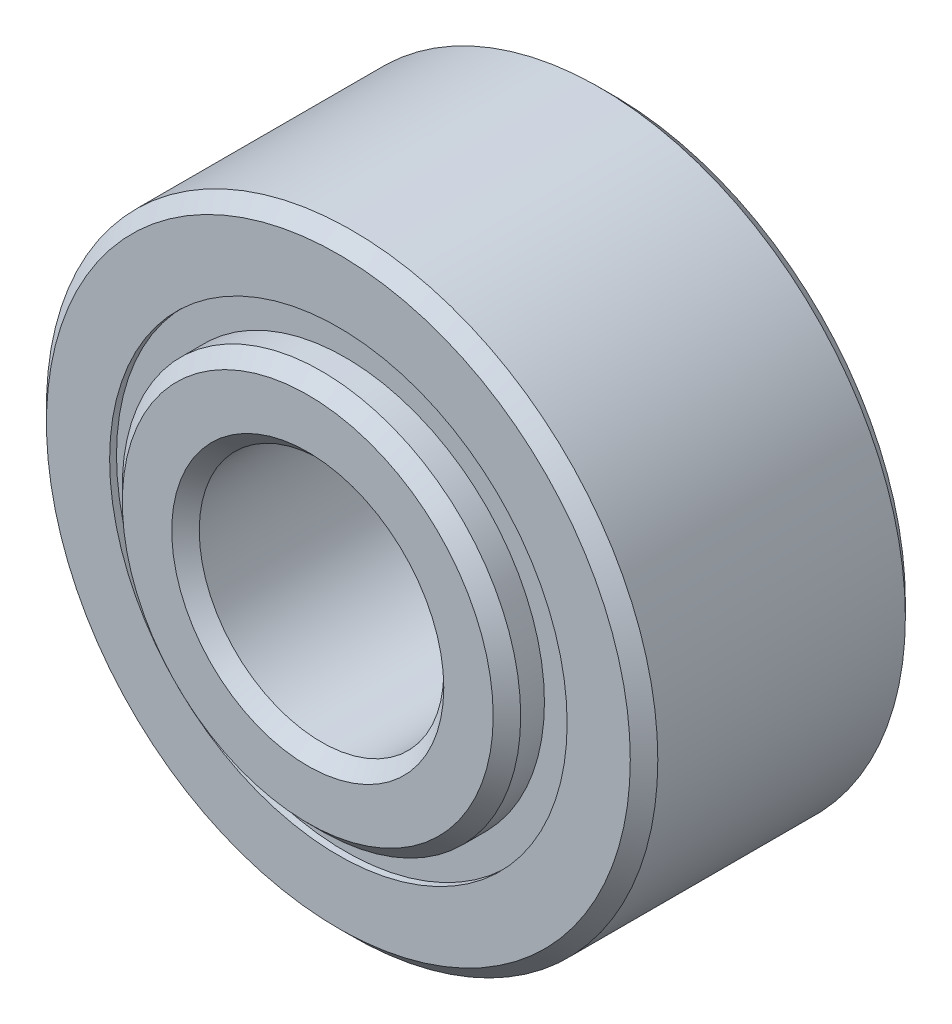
ISO-10303-21;
HEADER;
FILE_DESCRIPTION(('STEP AP214'),'2;1');
FILE_NAME('part.step','',(''),(''),'','','');
FILE_SCHEMA(('AUTOMOTIVE_DESIGN { 1 0 10303 214 1 1 1 1 }'));
ENDSEC;
DATA;
#1=APPLICATION_CONTEXT('core data for automotive mechanical design processes');
#2=APPLICATION_PROTOCOL_DEFINITION('international standard','automotive_design',2000,#1);
#3=PRODUCT_CONTEXT('',#1,'mechanical');
#4=PRODUCT('Part','Part','',(#3));
#5=PRODUCT_RELATED_PRODUCT_CATEGORY('part','',(#4));
#6=PRODUCT_DEFINITION_FORMATION('','',#4);
#7=PRODUCT_DEFINITION_CONTEXT('part definition',#1,'design');
#8=PRODUCT_DEFINITION('design','',#6,#7);
#9=PRODUCT_DEFINITION_SHAPE('','',#8);
#10=(LENGTH_UNIT() NAMED_UNIT(*) SI_UNIT(.MILLI.,.METRE.));
#11=(NAMED_UNIT(*) PLANE_ANGLE_UNIT() SI_UNIT($,.RADIAN.));
#12=(NAMED_UNIT(*) SI_UNIT($,.STERADIAN.) SOLID_ANGLE_UNIT());
#13=UNCERTAINTY_MEASURE_WITH_UNIT(LENGTH_MEASURE(1.E-05),#10,'distance_accuracy_value','');
#14=(GEOMETRIC_REPRESENTATION_CONTEXT(3) GLOBAL_UNCERTAINTY_ASSIGNED_CONTEXT((#13)) GLOBAL_UNIT_ASSIGNED_CONTEXT((#10,
#11,#12)) REPRESENTATION_CONTEXT('',''));
#15=CARTESIAN_POINT('',(0.,0.,0.));
#16=DIRECTION('',(0.,0.,1.));
#17=DIRECTION('',(1.,0.,0.));
#18=AXIS2_PLACEMENT_3D('',#15,#16,#17);
#19=CARTESIAN_POINT('',(0.,2.97004851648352,-1.696339));
#20=DIRECTION('',(0.,0.,1.));
#21=DIRECTION('',(1.,0.,0.));
#22=AXIS2_PLACEMENT_3D('',#19,#20,#21);
#23=PLANE('',#22);
#24=CARTESIAN_POINT('',(0.,0.,-1.696339));
#25=DIRECTION('',(0.,0.,1.));
#26=DIRECTION('',(1.,0.,0.));
#27=AXIS2_PLACEMENT_3D('',#24,#25,#26);
#28=CIRCLE('',#27,2.97004851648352);
#29=CARTESIAN_POINT('',(2.97004851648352,0.,-1.696339));
#30=VERTEX_POINT('',#29);
#31=EDGE_CURVE('E66',#30,#30,#28,.T.);
#32=ORIENTED_EDGE('',*,*,#31,.F.);
#33=EDGE_LOOP('',(#32));
#34=FACE_BOUND('',#33,.T.);
#35=CARTESIAN_POINT('',(0.,0.,-1.696339));
#36=DIRECTION('',(0.,0.,1.));
#37=DIRECTION('',(1.,0.,0.));
#38=AXIS2_PLACEMENT_3D('',#35,#36,#37);
#39=CIRCLE('',#38,2.58620148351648);
#40=CARTESIAN_POINT('',(2.58620148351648,0.,-1.696339));
#41=VERTEX_POINT('',#40);
#42=EDGE_CURVE('E11',#41,#41,#39,.T.);
#43=ORIENTED_EDGE('',*,*,#42,.T.);
#44=EDGE_LOOP('',(#43));
#45=FACE_BOUND('',#44,.T.);
#46=ADVANCED_FACE('F52',(#34,#45),#23,.F.);
#47=CARTESIAN_POINT('',(0.,0.,1.78562));
#48=DIRECTION('',(0.,0.,1.));
#49=DIRECTION('',(1.,0.,0.));
#50=AXIS2_PLACEMENT_3D('',#47,#48,#49);
#51=CYLINDRICAL_SURFACE('',#50,2.58620148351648);
#52=ORIENTED_EDGE('',*,*,#42,.F.);
#53=EDGE_LOOP('',(#52));
#54=FACE_BOUND('',#53,.T.);
#55=CARTESIAN_POINT('',(0.,0.,-0.816486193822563));
#56=DIRECTION('',(0.,0.,1.));
#57=DIRECTION('',(1.,0.,0.));
#58=AXIS2_PLACEMENT_3D('',#55,#56,#57);
#59=CIRCLE('',#58,2.58620148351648);
#60=CARTESIAN_POINT('',(2.58620148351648,0.,-0.816486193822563));
#61=VERTEX_POINT('',#60);
#62=EDGE_CURVE('E58',#61,#61,#59,.T.);
#63=ORIENTED_EDGE('',*,*,#62,.T.);
#64=EDGE_LOOP('',(#63));
#65=FACE_BOUND('',#64,.T.);
#66=ADVANCED_FACE('F75',(#54,#65),#51,.F.);
#67=CARTESIAN_POINT('',(0.,2.97004851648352,-0.816486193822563));
#68=DIRECTION('',(0.,0.,-1.));
#69=DIRECTION('',(-1.,0.,0.));
#70=AXIS2_PLACEMENT_3D('',#67,#68,#69);
#71=PLANE('',#70);
#72=ORIENTED_EDGE('',*,*,#62,.F.);
#73=EDGE_LOOP('',(#72));
#74=FACE_BOUND('',#73,.T.);
#75=CARTESIAN_POINT('',(0.,0.,-0.816486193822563));
#76=DIRECTION('',(0.,0.,1.));
#77=DIRECTION('',(1.,0.,0.));
#78=AXIS2_PLACEMENT_3D('',#75,#76,#77);
#79=CIRCLE('',#78,2.97004851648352);
#80=CARTESIAN_POINT('',(2.97004851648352,0.,-0.816486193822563));
#81=VERTEX_POINT('',#80);
#82=EDGE_CURVE('E62',#81,#81,#79,.T.);
#83=ORIENTED_EDGE('',*,*,#82,.T.);
#84=EDGE_LOOP('',(#83));
#85=FACE_BOUND('',#84,.T.);
#86=ADVANCED_FACE('F79',(#74,#85),#71,.F.);
#87=CARTESIAN_POINT('',(0.,0.,1.78562));
#88=DIRECTION('',(0.,0.,1.));
#89=DIRECTION('',(1.,0.,0.));
#90=AXIS2_PLACEMENT_3D('',#87,#88,#89);
#91=CYLINDRICAL_SURFACE('',#90,2.97004851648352);
#92=ORIENTED_EDGE('',*,*,#82,.F.);
#93=EDGE_LOOP('',(#92));
#94=FACE_BOUND('',#93,.T.);
#95=ORIENTED_EDGE('',*,*,#31,.T.);
#96=EDGE_LOOP('',(#95));
#97=FACE_BOUND('',#96,.T.);
#98=ADVANCED_FACE('F72',(#94,#97),#91,.T.);
#99=CLOSED_SHELL('',(#46,#66,#86,#98));
#100=MANIFOLD_SOLID_BREP('B2',#99);
#101=CARTESIAN_POINT('',(0.,2.97004851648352,1.696339));
#102=DIRECTION('',(0.,0.,-1.));
#103=DIRECTION('',(-1.,0.,0.));
#104=AXIS2_PLACEMENT_3D('',#101,#102,#103);
#105=PLANE('',#104);
#106=CARTESIAN_POINT('',(0.,0.,1.696339));
#107=DIRECTION('',(0.,0.,1.));
#108=DIRECTION('',(1.,0.,0.));
#109=AXIS2_PLACEMENT_3D('',#106,#107,#108);
#110=CIRCLE('',#109,2.58620148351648);
#111=CARTESIAN_POINT('',(2.58620148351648,0.,1.696339));
#112=VERTEX_POINT('',#111);
#113=EDGE_CURVE('E51',#112,#112,#110,.T.);
#114=ORIENTED_EDGE('',*,*,#113,.F.);
#115=EDGE_LOOP('',(#114));
#116=FACE_BOUND('',#115,.T.);
#117=CARTESIAN_POINT('',(0.,0.,1.696339));
#118=DIRECTION('',(0.,0.,1.));
#119=DIRECTION('',(1.,0.,0.));
#120=AXIS2_PLACEMENT_3D('',#117,#118,#119);
#121=CIRCLE('',#120,2.97004851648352);
#122=CARTESIAN_POINT('',(2.97004851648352,0.,1.696339));
#123=VERTEX_POINT('',#122);
#124=EDGE_CURVE('E138',#123,#123,#121,.T.);
#125=ORIENTED_EDGE('',*,*,#124,.T.);
#126=EDGE_LOOP('',(#125));
#127=FACE_BOUND('',#126,.T.);
#128=ADVANCED_FACE('F120',(#116,#127),#105,.F.);
#129=CARTESIAN_POINT('',(0.,0.,1.78562));
#130=DIRECTION('',(0.,0.,1.));
#131=DIRECTION('',(1.,0.,0.));
#132=AXIS2_PLACEMENT_3D('',#129,#130,#131);
#133=CYLINDRICAL_SURFACE('',#132,2.58620148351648);
#134=CARTESIAN_POINT('',(0.,0.,0.816486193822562));
#135=DIRECTION('',(0.,0.,1.));
#136=DIRECTION('',(1.,0.,0.));
#137=AXIS2_PLACEMENT_3D('',#134,#135,#136);
#138=CIRCLE('',#137,2.58620148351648);
#139=CARTESIAN_POINT('',(2.58620148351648,0.,0.816486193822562));
#140=VERTEX_POINT('',#139);
#141=EDGE_CURVE('E127',#140,#140,#138,.T.);
#142=ORIENTED_EDGE('',*,*,#141,.F.);
#143=EDGE_LOOP('',(#142));
#144=FACE_BOUND('',#143,.T.);
#145=ORIENTED_EDGE('',*,*,#113,.T.);
#146=EDGE_LOOP('',(#145));
#147=FACE_BOUND('',#146,.T.);
#148=ADVANCED_FACE('F153',(#144,#147),#133,.F.);
#149=CARTESIAN_POINT('',(0.,2.97004851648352,0.816486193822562));
#150=DIRECTION('',(0.,0.,1.));
#151=DIRECTION('',(1.,0.,0.));
#152=AXIS2_PLACEMENT_3D('',#149,#150,#151);
#153=PLANE('',#152);
#154=CARTESIAN_POINT('',(0.,0.,0.816486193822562));
#155=DIRECTION('',(0.,0.,1.));
#156=DIRECTION('',(1.,0.,0.));
#157=AXIS2_PLACEMENT_3D('',#154,#155,#156);
#158=CIRCLE('',#157,2.97004851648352);
#159=CARTESIAN_POINT('',(2.97004851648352,0.,0.816486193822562));
#160=VERTEX_POINT('',#159);
#161=EDGE_CURVE('E132',#160,#160,#158,.T.);
#162=ORIENTED_EDGE('',*,*,#161,.F.);
#163=EDGE_LOOP('',(#162));
#164=FACE_BOUND('',#163,.T.);
#165=ORIENTED_EDGE('',*,*,#141,.T.);
#166=EDGE_LOOP('',(#165));
#167=FACE_BOUND('',#166,.T.);
#168=ADVANCED_FACE('F148',(#164,#167),#153,.F.);
#169=CARTESIAN_POINT('',(0.,0.,1.78562));
#170=DIRECTION('',(0.,0.,1.));
#171=DIRECTION('',(1.,0.,0.));
#172=AXIS2_PLACEMENT_3D('',#169,#170,#171);
#173=CYLINDRICAL_SURFACE('',#172,2.97004851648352);
#174=ORIENTED_EDGE('',*,*,#124,.F.);
#175=EDGE_LOOP('',(#174));
#176=FACE_BOUND('',#175,.T.);
#177=ORIENTED_EDGE('',*,*,#161,.T.);
#178=EDGE_LOOP('',(#177));
#179=FACE_BOUND('',#178,.T.);
#180=ADVANCED_FACE('F145',(#176,#179),#173,.T.);
#181=CLOSED_SHELL('',(#128,#148,#168,#180));
#182=MANIFOLD_SOLID_BREP('B6',#181);
#183=CARTESIAN_POINT('',(-1.632940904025,2.24755033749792,0.));
#184=DIRECTION('',(0.,0.,1.));
#185=DIRECTION('',(-0.587785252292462,0.809016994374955,0.));
#186=AXIS2_PLACEMENT_3D('',#183,#184,#185);
#187=SPHERICAL_SURFACE('',#186,0.816486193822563);
#188=CARTESIAN_POINT('',(-1.632940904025,2.24755033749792,0.816486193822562));
#189=VERTEX_POINT('',#188);
#190=VERTEX_LOOP('',#189);
#191=FACE_BOUND('',#190,.T.);
#192=ADVANCED_FACE('F191',(#191),#187,.T.);
#193=CLOSED_SHELL('',(#192));
#194=MANIFOLD_SOLID_BREP('B46',#193);
#195=CARTESIAN_POINT('',(-2.64215388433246,0.858487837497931,0.));
#196=DIRECTION('',(0.,0.,1.));
#197=DIRECTION('',(-0.95105651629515,0.309016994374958,0.));
#198=AXIS2_PLACEMENT_3D('',#195,#196,#197);
#199=SPHERICAL_SURFACE('',#198,0.816486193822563);
#200=CARTESIAN_POINT('',(-2.64215388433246,0.858487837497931,0.816486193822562));
#201=VERTEX_POINT('',#200);
#202=VERTEX_LOOP('',#201);
#203=FACE_BOUND('',#202,.T.);
#204=ADVANCED_FACE('F211',(#203),#199,.T.);
#205=CLOSED_SHELL('',(#204));
#206=MANIFOLD_SOLID_BREP('B116',#205);
#207=CARTESIAN_POINT('',(-2.64215388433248,-0.858487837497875,0.));
#208=DIRECTION('',(0.,0.,1.));
#209=DIRECTION('',(-0.951056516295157,-0.309016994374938,0.));
#210=AXIS2_PLACEMENT_3D('',#207,#208,#209);
#211=SPHERICAL_SURFACE('',#210,0.816486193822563);
#212=CARTESIAN_POINT('',(-2.64215388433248,-0.858487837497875,0.816486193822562));
#213=VERTEX_POINT('',#212);
#214=VERTEX_LOOP('',#213);
#215=FACE_BOUND('',#214,.T.);
#216=ADVANCED_FACE('F231',(#215),#211,.T.);
#217=CLOSED_SHELL('',(#216));
#218=MANIFOLD_SOLID_BREP('B187',#217);
#219=CARTESIAN_POINT('',(-1.63294090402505,-2.24755033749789,0.));
#220=DIRECTION('',(0.,0.,1.));
#221=DIRECTION('',(-0.58778525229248,-0.809016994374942,0.));
#222=AXIS2_PLACEMENT_3D('',#219,#220,#221);
#223=SPHERICAL_SURFACE('',#222,0.816486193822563);
#224=CARTESIAN_POINT('',(-1.63294090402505,-2.24755033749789,0.816486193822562));
#225=VERTEX_POINT('',#224);
#226=VERTEX_LOOP('',#225);
#227=FACE_BOUND('',#226,.T.);
#228=ADVANCED_FACE('F251',(#227),#223,.T.);
#229=CLOSED_SHELL('',(#228));
#230=MANIFOLD_SOLID_BREP('B207',#229);
#231=CARTESIAN_POINT('',(0.,-2.778125,0.));
#232=DIRECTION('',(0.,0.,1.));
#233=DIRECTION('',(0.,-1.,0.));
#234=AXIS2_PLACEMENT_3D('',#231,#232,#233);
#235=SPHERICAL_SURFACE('',#234,0.816486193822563);
#236=CARTESIAN_POINT('',(0.,-2.778125,0.816486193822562));
#237=VERTEX_POINT('',#236);
#238=VERTEX_LOOP('',#237);
#239=FACE_BOUND('',#238,.T.);
#240=ADVANCED_FACE('F271',(#239),#235,.T.);
#241=CLOSED_SHELL('',(#240));
#242=MANIFOLD_SOLID_BREP('B227',#241);
#243=CARTESIAN_POINT('',(1.63294090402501,-2.24755033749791,0.));
#244=DIRECTION('',(0.,0.,1.));
#245=DIRECTION('',(0.587785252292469,-0.809016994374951,0.));
#246=AXIS2_PLACEMENT_3D('',#243,#244,#245);
#247=SPHERICAL_SURFACE('',#246,0.816486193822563);
#248=CARTESIAN_POINT('',(1.63294090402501,-2.24755033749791,0.816486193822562));
#249=VERTEX_POINT('',#248);
#250=VERTEX_LOOP('',#249);
#251=FACE_BOUND('',#250,.T.);
#252=ADVANCED_FACE('F291',(#251),#247,.T.);
#253=CLOSED_SHELL('',(#252));
#254=MANIFOLD_SOLID_BREP('B247',#253);
#255=CARTESIAN_POINT('',(2.64215388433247,-0.858487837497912,0.));
#256=DIRECTION('',(0.,0.,1.));
#257=DIRECTION('',(0.951056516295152,-0.309016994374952,0.));
#258=AXIS2_PLACEMENT_3D('',#255,#256,#257);
#259=SPHERICAL_SURFACE('',#258,0.816486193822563);
#260=CARTESIAN_POINT('',(2.64215388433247,-0.858487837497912,0.816486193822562));
#261=VERTEX_POINT('',#260);
#262=VERTEX_LOOP('',#261);
#263=FACE_BOUND('',#262,.T.);
#264=ADVANCED_FACE('F311',(#263),#259,.T.);
#265=CLOSED_SHELL('',(#264));
#266=MANIFOLD_SOLID_BREP('B267',#265);
#267=CARTESIAN_POINT('',(2.64215388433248,0.858487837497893,0.));
#268=DIRECTION('',(0.,0.,1.));
#269=DIRECTION('',(0.951056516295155,0.309016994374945,0.));
#270=AXIS2_PLACEMENT_3D('',#267,#268,#269);
#271=SPHERICAL_SURFACE('',#270,0.816486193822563);
#272=CARTESIAN_POINT('',(2.64215388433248,0.858487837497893,0.816486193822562));
#273=VERTEX_POINT('',#272);
#274=VERTEX_LOOP('',#273);
#275=FACE_BOUND('',#274,.T.);
#276=ADVANCED_FACE('F331',(#275),#271,.T.);
#277=CLOSED_SHELL('',(#276));
#278=MANIFOLD_SOLID_BREP('B287',#277);
#279=CARTESIAN_POINT('',(1.63294090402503,2.2475503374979,0.));
#280=DIRECTION('',(0.,0.,1.));
#281=DIRECTION('',(0.587785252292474,0.809016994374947,0.));
#282=AXIS2_PLACEMENT_3D('',#279,#280,#281);
#283=SPHERICAL_SURFACE('',#282,0.816486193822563);
#284=CARTESIAN_POINT('',(1.63294090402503,2.2475503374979,0.816486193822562));
#285=VERTEX_POINT('',#284);
#286=VERTEX_LOOP('',#285);
#287=FACE_BOUND('',#286,.T.);
#288=ADVANCED_FACE('F351',(#287),#283,.T.);
#289=CLOSED_SHELL('',(#288));
#290=MANIFOLD_SOLID_BREP('B307',#289);
#291=CARTESIAN_POINT('',(0.,2.778125,0.));
#292=DIRECTION('',(0.,0.,1.));
#293=DIRECTION('',(0.,1.,0.));
#294=AXIS2_PLACEMENT_3D('',#291,#292,#293);
#295=SPHERICAL_SURFACE('',#294,0.816486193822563);
#296=CARTESIAN_POINT('',(0.,2.778125,0.816486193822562));
#297=VERTEX_POINT('',#296);
#298=VERTEX_LOOP('',#297);
#299=FACE_BOUND('',#298,.T.);
#300=ADVANCED_FACE('F374',(#299),#295,.T.);
#301=CLOSED_SHELL('',(#300));
#302=MANIFOLD_SOLID_BREP('B327',#301);
#303=CARTESIAN_POINT('',(0.,0.,2.004568));
#304=DIRECTION('',(0.,0.,-1.));
#305=DIRECTION('',(-1.,0.,0.));
#306=AXIS2_PLACEMENT_3D('',#303,#304,#305);
#307=CONICAL_SURFACE('',#306,2.58620148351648,0.785398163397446);
#308=CARTESIAN_POINT('',(0.,0.,2.18313));
#309=DIRECTION('',(0.,0.,1.));
#310=DIRECTION('',(1.,0.,0.));
#311=AXIS2_PLACEMENT_3D('',#308,#309,#310);
#312=CIRCLE('',#311,2.40763948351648);
#313=CARTESIAN_POINT('',(2.40763948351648,0.,2.18313));
#314=VERTEX_POINT('',#313);
#315=EDGE_CURVE('E433',#314,#314,#312,.T.);
#316=ORIENTED_EDGE('',*,*,#315,.F.);
#317=EDGE_LOOP('',(#316));
#318=FACE_BOUND('',#317,.T.);
#319=CARTESIAN_POINT('',(0.,0.,2.004568));
#320=DIRECTION('',(0.,0.,1.));
#321=DIRECTION('',(1.,0.,0.));
#322=AXIS2_PLACEMENT_3D('',#319,#320,#321);
#323=CIRCLE('',#322,2.58620148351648);
#324=CARTESIAN_POINT('',(2.58620148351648,0.,2.004568));
#325=VERTEX_POINT('',#324);
#326=EDGE_CURVE('E373',#325,#325,#323,.T.);
#327=ORIENTED_EDGE('',*,*,#326,.T.);
#328=EDGE_LOOP('',(#327));
#329=FACE_BOUND('',#328,.T.);
#330=ADVANCED_FACE('F394',(#318,#329),#307,.T.);
#331=CARTESIAN_POINT('',(0.,0.,1.78562));
#332=DIRECTION('',(0.,0.,1.));
#333=DIRECTION('',(1.,0.,0.));
#334=AXIS2_PLACEMENT_3D('',#331,#332,#333);
#335=CYLINDRICAL_SURFACE('',#334,2.58620148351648);
#336=ORIENTED_EDGE('',*,*,#326,.F.);
#337=EDGE_LOOP('',(#336));
#338=FACE_BOUND('',#337,.T.);
#339=CARTESIAN_POINT('',(0.,0.,0.793608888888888));
#340=DIRECTION('',(0.,0.,1.));
#341=DIRECTION('',(1.,0.,0.));
#342=AXIS2_PLACEMENT_3D('',#339,#340,#341);
#343=CIRCLE('',#342,2.58620148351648);
#344=CARTESIAN_POINT('',(2.58620148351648,0.,0.793608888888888));
#345=VERTEX_POINT('',#344);
#346=EDGE_CURVE('E401',#345,#345,#343,.T.);
#347=ORIENTED_EDGE('',*,*,#346,.T.);
#348=EDGE_LOOP('',(#347));
#349=FACE_BOUND('',#348,.T.);
#350=ADVANCED_FACE('F440',(#338,#349),#335,.T.);
#351=CARTESIAN_POINT('',(0.,0.,0.));
#352=DIRECTION('',(0.,0.,1.));
#353=DIRECTION('',(1.,0.,0.));
#354=AXIS2_PLACEMENT_3D('',#351,#352,#353);
#355=TOROIDAL_SURFACE('',#354,2.77812499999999,0.816486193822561);
#356=ORIENTED_EDGE('',*,*,#346,.F.);
#357=EDGE_LOOP('',(#356));
#358=FACE_BOUND('',#357,.T.);
#359=CARTESIAN_POINT('',(0.,0.,-0.793608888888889));
#360=DIRECTION('',(0.,0.,1.));
#361=DIRECTION('',(1.,0.,0.));
#362=AXIS2_PLACEMENT_3D('',#359,#360,#361);
#363=CIRCLE('',#362,2.58620148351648);
#364=CARTESIAN_POINT('',(2.58620148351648,0.,-0.793608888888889));
#365=VERTEX_POINT('',#364);
#366=EDGE_CURVE('E407',#365,#365,#363,.T.);
#367=ORIENTED_EDGE('',*,*,#366,.T.);
#368=EDGE_LOOP('',(#367));
#369=FACE_BOUND('',#368,.T.);
#370=ADVANCED_FACE('F444',(#358,#369),#355,.F.);
#371=CARTESIAN_POINT('',(0.,0.,1.78562));
#372=DIRECTION('',(0.,0.,1.));
#373=DIRECTION('',(1.,0.,0.));
#374=AXIS2_PLACEMENT_3D('',#371,#372,#373);
#375=CYLINDRICAL_SURFACE('',#374,2.58620148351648);
#376=ORIENTED_EDGE('',*,*,#366,.F.);
#377=EDGE_LOOP('',(#376));
#378=FACE_BOUND('',#377,.T.);
#379=CARTESIAN_POINT('',(0.,0.,-2.004568));
#380=DIRECTION('',(0.,0.,1.));
#381=DIRECTION('',(1.,0.,0.));
#382=AXIS2_PLACEMENT_3D('',#379,#380,#381);
#383=CIRCLE('',#382,2.58620148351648);
#384=CARTESIAN_POINT('',(2.58620148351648,0.,-2.004568));
#385=VERTEX_POINT('',#384);
#386=EDGE_CURVE('E411',#385,#385,#383,.T.);
#387=ORIENTED_EDGE('',*,*,#386,.T.);
#388=EDGE_LOOP('',(#387));
#389=FACE_BOUND('',#388,.T.);
#390=ADVANCED_FACE('F449',(#378,#389),#375,.T.);
#391=CARTESIAN_POINT('',(0.,0.,-2.18313));
#392=DIRECTION('',(0.,0.,1.));
#393=DIRECTION('',(1.,0.,0.));
#394=AXIS2_PLACEMENT_3D('',#391,#392,#393);
#395=CONICAL_SURFACE('',#394,2.40763948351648,0.785398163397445);
#396=ORIENTED_EDGE('',*,*,#386,.F.);
#397=EDGE_LOOP('',(#396));
#398=FACE_BOUND('',#397,.T.);
#399=CARTESIAN_POINT('',(0.,0.,-2.18313));
#400=DIRECTION('',(0.,0.,1.));
#401=DIRECTION('',(1.,0.,0.));
#402=AXIS2_PLACEMENT_3D('',#399,#400,#401);
#403=CIRCLE('',#402,2.40763948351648);
#404=CARTESIAN_POINT('',(2.40763948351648,0.,-2.18313));
#405=VERTEX_POINT('',#404);
#406=EDGE_CURVE('E416',#405,#405,#403,.T.);
#407=ORIENTED_EDGE('',*,*,#406,.T.);
#408=EDGE_LOOP('',(#407));
#409=FACE_BOUND('',#408,.T.);
#410=ADVANCED_FACE('F455',(#398,#409),#395,.T.);
#411=CARTESIAN_POINT('',(0.,2.40763948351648,-2.18313));
#412=DIRECTION('',(0.,0.,1.));
#413=DIRECTION('',(1.,0.,0.));
#414=AXIS2_PLACEMENT_3D('',#411,#412,#413);
#415=PLANE('',#414);
#416=ORIENTED_EDGE('',*,*,#406,.F.);
#417=EDGE_LOOP('',(#416));
#418=FACE_BOUND('',#417,.T.);
#419=CARTESIAN_POINT('',(0.,0.,-2.18313));
#420=DIRECTION('',(0.,0.,1.));
#421=DIRECTION('',(1.,0.,0.));
#422=AXIS2_PLACEMENT_3D('',#419,#420,#421);
#423=CIRCLE('',#422,1.766062);
#424=CARTESIAN_POINT('',(1.766062,0.,-2.18313));
#425=VERTEX_POINT('',#424);
#426=EDGE_CURVE('E419',#425,#425,#423,.T.);
#427=ORIENTED_EDGE('',*,*,#426,.T.);
#428=EDGE_LOOP('',(#427));
#429=FACE_BOUND('',#428,.T.);
#430=ADVANCED_FACE('F459',(#418,#429),#415,.F.);
#431=CARTESIAN_POINT('',(0.,0.,-2.004568));
#432=DIRECTION('',(0.,0.,-1.));
#433=DIRECTION('',(-1.,0.,0.));
#434=AXIS2_PLACEMENT_3D('',#431,#432,#433);
#435=CONICAL_SURFACE('',#434,1.5875,0.785398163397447);
#436=ORIENTED_EDGE('',*,*,#426,.F.);
#437=EDGE_LOOP('',(#436));
#438=FACE_BOUND('',#437,.T.);
#439=CARTESIAN_POINT('',(0.,0.,-2.004568));
#440=DIRECTION('',(0.,0.,1.));
#441=DIRECTION('',(1.,0.,0.));
#442=AXIS2_PLACEMENT_3D('',#439,#440,#441);
#443=CIRCLE('',#442,1.5875);
#444=CARTESIAN_POINT('',(1.5875,0.,-2.004568));
#445=VERTEX_POINT('',#444);
#446=EDGE_CURVE('E422',#445,#445,#443,.T.);
#447=ORIENTED_EDGE('',*,*,#446,.T.);
#448=EDGE_LOOP('',(#447));
#449=FACE_BOUND('',#448,.T.);
#450=ADVANCED_FACE('F463',(#438,#449),#435,.F.);
#451=CARTESIAN_POINT('',(0.,0.,1.78562));
#452=DIRECTION('',(0.,0.,1.));
#453=DIRECTION('',(1.,0.,0.));
#454=AXIS2_PLACEMENT_3D('',#451,#452,#453);
#455=CYLINDRICAL_SURFACE('',#454,1.5875);
#456=ORIENTED_EDGE('',*,*,#446,.F.);
#457=EDGE_LOOP('',(#456));
#458=FACE_BOUND('',#457,.T.);
#459=CARTESIAN_POINT('',(0.,0.,2.004568));
#460=DIRECTION('',(0.,0.,1.));
#461=DIRECTION('',(1.,0.,0.));
#462=AXIS2_PLACEMENT_3D('',#459,#460,#461);
#463=CIRCLE('',#462,1.5875);
#464=CARTESIAN_POINT('',(1.5875,0.,2.004568));
#465=VERTEX_POINT('',#464);
#466=EDGE_CURVE('E425',#465,#465,#463,.T.);
#467=ORIENTED_EDGE('',*,*,#466,.T.);
#468=EDGE_LOOP('',(#467));
#469=FACE_BOUND('',#468,.T.);
#470=ADVANCED_FACE('F467',(#458,#469),#455,.F.);
#471=CARTESIAN_POINT('',(0.,0.,2.18313));
#472=DIRECTION('',(0.,0.,1.));
#473=DIRECTION('',(1.,0.,0.));
#474=AXIS2_PLACEMENT_3D('',#471,#472,#473);
#475=CONICAL_SURFACE('',#474,1.766062,0.78539816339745);
#476=ORIENTED_EDGE('',*,*,#466,.F.);
#477=EDGE_LOOP('',(#476));
#478=FACE_BOUND('',#477,.T.);
#479=CARTESIAN_POINT('',(0.,0.,2.18313));
#480=DIRECTION('',(0.,0.,1.));
#481=DIRECTION('',(1.,0.,0.));
#482=AXIS2_PLACEMENT_3D('',#479,#480,#481);
#483=CIRCLE('',#482,1.766062);
#484=CARTESIAN_POINT('',(1.766062,0.,2.18313));
#485=VERTEX_POINT('',#484);
#486=EDGE_CURVE('E429',#485,#485,#483,.T.);
#487=ORIENTED_EDGE('',*,*,#486,.T.);
#488=EDGE_LOOP('',(#487));
#489=FACE_BOUND('',#488,.T.);
#490=ADVANCED_FACE('F471',(#478,#489),#475,.F.);
#491=CARTESIAN_POINT('',(0.,1.766062,2.18313));
#492=DIRECTION('',(0.,0.,-1.));
#493=DIRECTION('',(-1.,0.,0.));
#494=AXIS2_PLACEMENT_3D('',#491,#492,#493);
#495=PLANE('',#494);
#496=ORIENTED_EDGE('',*,*,#486,.F.);
#497=EDGE_LOOP('',(#496));
#498=FACE_BOUND('',#497,.T.);
#499=ORIENTED_EDGE('',*,*,#315,.T.);
#500=EDGE_LOOP('',(#499));
#501=FACE_BOUND('',#500,.T.);
#502=ADVANCED_FACE('F437',(#498,#501),#495,.F.);
#503=CLOSED_SHELL('',(#330,#350,#370,#390,#410,#430,#450,#470,#490,#502));
#504=MANIFOLD_SOLID_BREP('B347',#503);
#505=CARTESIAN_POINT('',(0.,0.,1.607058));
#506=DIRECTION('',(0.,0.,-1.));
#507=DIRECTION('',(-1.,0.,0.));
#508=AXIS2_PLACEMENT_3D('',#505,#506,#507);
#509=CONICAL_SURFACE('',#508,3.96875,0.785398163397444);
#510=CARTESIAN_POINT('',(0.,0.,1.78562));
#511=DIRECTION('',(0.,0.,1.));
#512=DIRECTION('',(1.,0.,0.));
#513=AXIS2_PLACEMENT_3D('',#510,#511,#512);
#514=CIRCLE('',#513,3.790188);
#515=CARTESIAN_POINT('',(3.790188,0.,1.78562));
#516=VERTEX_POINT('',#515);
#517=EDGE_CURVE('E582',#516,#516,#514,.T.);
#518=ORIENTED_EDGE('',*,*,#517,.F.);
#519=EDGE_LOOP('',(#518));
#520=FACE_BOUND('',#519,.T.);
#521=CARTESIAN_POINT('',(0.,0.,1.607058));
#522=DIRECTION('',(0.,0.,1.));
#523=DIRECTION('',(1.,0.,0.));
#524=AXIS2_PLACEMENT_3D('',#521,#522,#523);
#525=CIRCLE('',#524,3.96875);
#526=CARTESIAN_POINT('',(3.96875,0.,1.607058));
#527=VERTEX_POINT('',#526);
#528=EDGE_CURVE('E393',#527,#527,#525,.T.);
#529=ORIENTED_EDGE('',*,*,#528,.T.);
#530=EDGE_LOOP('',(#529));
#531=FACE_BOUND('',#530,.T.);
#532=ADVANCED_FACE('F551',(#520,#531),#509,.T.);
#533=CARTESIAN_POINT('',(0.,0.,1.78562));
#534=DIRECTION('',(0.,0.,1.));
#535=DIRECTION('',(1.,0.,0.));
#536=AXIS2_PLACEMENT_3D('',#533,#534,#535);
#537=CYLINDRICAL_SURFACE('',#536,3.96875);
#538=ORIENTED_EDGE('',*,*,#528,.F.);
#539=EDGE_LOOP('',(#538));
#540=FACE_BOUND('',#539,.T.);
#541=CARTESIAN_POINT('',(0.,0.,-1.607058));
#542=DIRECTION('',(0.,0.,1.));
#543=DIRECTION('',(1.,0.,0.));
#544=AXIS2_PLACEMENT_3D('',#541,#542,#543);
#545=CIRCLE('',#544,3.96875);
#546=CARTESIAN_POINT('',(3.96875,0.,-1.607058));
#547=VERTEX_POINT('',#546);
#548=EDGE_CURVE('E558',#547,#547,#545,.T.);
#549=ORIENTED_EDGE('',*,*,#548,.T.);
#550=EDGE_LOOP('',(#549));
#551=FACE_BOUND('',#550,.T.);
#552=ADVANCED_FACE('F590',(#540,#551),#537,.T.);
#553=CARTESIAN_POINT('',(0.,0.,-1.78562));
#554=DIRECTION('',(0.,0.,1.));
#555=DIRECTION('',(1.,0.,0.));
#556=AXIS2_PLACEMENT_3D('',#553,#554,#555);
#557=CONICAL_SURFACE('',#556,3.790188,0.785398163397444);
#558=ORIENTED_EDGE('',*,*,#548,.F.);
#559=EDGE_LOOP('',(#558));
#560=FACE_BOUND('',#559,.T.);
#561=CARTESIAN_POINT('',(0.,0.,-1.78562));
#562=DIRECTION('',(0.,0.,1.));
#563=DIRECTION('',(1.,0.,0.));
#564=AXIS2_PLACEMENT_3D('',#561,#562,#563);
#565=CIRCLE('',#564,3.790188);
#566=CARTESIAN_POINT('',(3.790188,0.,-1.78562));
#567=VERTEX_POINT('',#566);
#568=EDGE_CURVE('E563',#567,#567,#565,.T.);
#569=ORIENTED_EDGE('',*,*,#568,.T.);
#570=EDGE_LOOP('',(#569));
#571=FACE_BOUND('',#570,.T.);
#572=ADVANCED_FACE('F594',(#560,#571),#557,.T.);
#573=CARTESIAN_POINT('',(0.,3.790188,-1.78562));
#574=DIRECTION('',(0.,0.,1.));
#575=DIRECTION('',(1.,0.,0.));
#576=AXIS2_PLACEMENT_3D('',#573,#574,#575);
#577=PLANE('',#576);
#578=ORIENTED_EDGE('',*,*,#568,.F.);
#579=EDGE_LOOP('',(#578));
#580=FACE_BOUND('',#579,.T.);
#581=CARTESIAN_POINT('',(0.,0.,-1.78562));
#582=DIRECTION('',(0.,0.,1.));
#583=DIRECTION('',(1.,0.,0.));
#584=AXIS2_PLACEMENT_3D('',#581,#582,#583);
#585=CIRCLE('',#584,2.97004851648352);
#586=CARTESIAN_POINT('',(2.97004851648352,0.,-1.78562));
#587=VERTEX_POINT('',#586);
#588=EDGE_CURVE('E567',#587,#587,#585,.T.);
#589=ORIENTED_EDGE('',*,*,#588,.T.);
#590=EDGE_LOOP('',(#589));
#591=FACE_BOUND('',#590,.T.);
#592=ADVANCED_FACE('F599',(#580,#591),#577,.F.);
#593=CARTESIAN_POINT('',(0.,0.,1.78562));
#594=DIRECTION('',(0.,0.,1.));
#595=DIRECTION('',(1.,0.,0.));
#596=AXIS2_PLACEMENT_3D('',#593,#594,#595);
#597=CYLINDRICAL_SURFACE('',#596,2.97004851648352);
#598=ORIENTED_EDGE('',*,*,#588,.F.);
#599=EDGE_LOOP('',(#598));
#600=FACE_BOUND('',#599,.T.);
#601=CARTESIAN_POINT('',(0.,0.,-0.793608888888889));
#602=DIRECTION('',(0.,0.,1.));
#603=DIRECTION('',(1.,0.,0.));
#604=AXIS2_PLACEMENT_3D('',#601,#602,#603);
#605=CIRCLE('',#604,2.97004851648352);
#606=CARTESIAN_POINT('',(2.97004851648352,0.,-0.793608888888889));
#607=VERTEX_POINT('',#606);
#608=EDGE_CURVE('E572',#607,#607,#605,.T.);
#609=ORIENTED_EDGE('',*,*,#608,.T.);
#610=EDGE_LOOP('',(#609));
#611=FACE_BOUND('',#610,.T.);
#612=ADVANCED_FACE('F605',(#600,#611),#597,.F.);
#613=CARTESIAN_POINT('',(0.,0.,0.));
#614=DIRECTION('',(0.,0.,1.));
#615=DIRECTION('',(1.,0.,0.));
#616=AXIS2_PLACEMENT_3D('',#613,#614,#615);
#617=TOROIDAL_SURFACE('',#616,2.778125,0.816486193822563);
#618=ORIENTED_EDGE('',*,*,#608,.F.);
#619=EDGE_LOOP('',(#618));
#620=FACE_BOUND('',#619,.T.);
#621=CARTESIAN_POINT('',(0.,0.,0.793608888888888));
#622=DIRECTION('',(0.,0.,1.));
#623=DIRECTION('',(1.,0.,0.));
#624=AXIS2_PLACEMENT_3D('',#621,#622,#623);
#625=CIRCLE('',#624,2.97004851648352);
#626=CARTESIAN_POINT('',(2.97004851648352,0.,0.793608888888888));
#627=VERTEX_POINT('',#626);
#628=EDGE_CURVE('E575',#627,#627,#625,.T.);
#629=ORIENTED_EDGE('',*,*,#628,.T.);
#630=EDGE_LOOP('',(#629));
#631=FACE_BOUND('',#630,.T.);
#632=ADVANCED_FACE('F609',(#620,#631),#617,.F.);
#633=CARTESIAN_POINT('',(0.,0.,1.78562));
#634=DIRECTION('',(0.,0.,1.));
#635=DIRECTION('',(1.,0.,0.));
#636=AXIS2_PLACEMENT_3D('',#633,#634,#635);
#637=CYLINDRICAL_SURFACE('',#636,2.97004851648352);
#638=ORIENTED_EDGE('',*,*,#628,.F.);
#639=EDGE_LOOP('',(#638));
#640=FACE_BOUND('',#639,.T.);
#641=CARTESIAN_POINT('',(0.,0.,1.78562));
#642=DIRECTION('',(0.,0.,1.));
#643=DIRECTION('',(1.,0.,0.));
#644=AXIS2_PLACEMENT_3D('',#641,#642,#643);
#645=CIRCLE('',#644,2.97004851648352);
#646=CARTESIAN_POINT('',(2.97004851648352,0.,1.78562));
#647=VERTEX_POINT('',#646);
#648=EDGE_CURVE('E578',#647,#647,#645,.T.);
#649=ORIENTED_EDGE('',*,*,#648,.T.);
#650=EDGE_LOOP('',(#649));
#651=FACE_BOUND('',#650,.T.);
#652=ADVANCED_FACE('F613',(#640,#651),#637,.F.);
#653=CARTESIAN_POINT('',(0.,3.790188,1.78562));
#654=DIRECTION('',(0.,0.,-1.));
#655=DIRECTION('',(-1.,0.,0.));
#656=AXIS2_PLACEMENT_3D('',#653,#654,#655);
#657=PLANE('',#656);
#658=ORIENTED_EDGE('',*,*,#648,.F.);
#659=EDGE_LOOP('',(#658));
#660=FACE_BOUND('',#659,.T.);
#661=ORIENTED_EDGE('',*,*,#517,.T.);
#662=EDGE_LOOP('',(#661));
#663=FACE_BOUND('',#662,.T.);
#664=ADVANCED_FACE('F587',(#660,#663),#657,.F.);
#665=CLOSED_SHELL('',(#532,#552,#572,#592,#612,#632,#652,#664));
#666=MANIFOLD_SOLID_BREP('B368',#665);
#667=ADVANCED_BREP_SHAPE_REPRESENTATION('',(#18,#100,#182,#194,#206,#218,#230,#242,#254,#266,
#278,#290,#302,#504,#666),#14);
#668=SHAPE_DEFINITION_REPRESENTATION(#9,#667);
ENDSEC;
END-ISO-10303-21;
